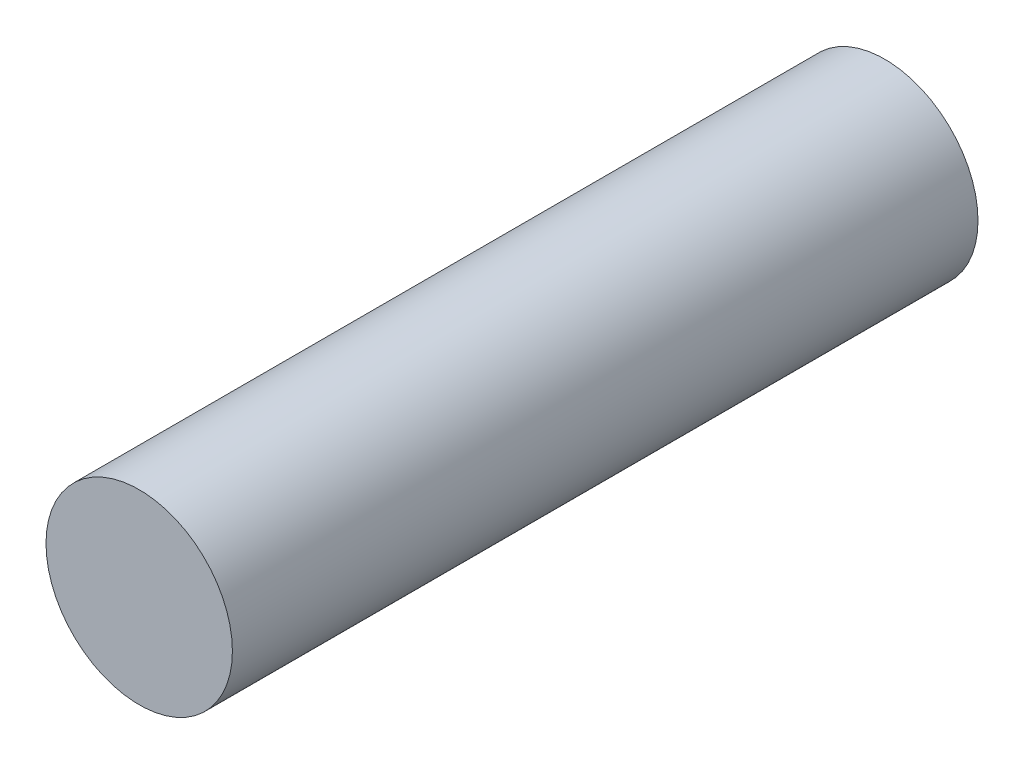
ISO-10303-21;
HEADER;
FILE_DESCRIPTION(('STEP AP214'),'2;1');
FILE_NAME('part.step','',(''),(''),'','','');
FILE_SCHEMA(('AUTOMOTIVE_DESIGN { 1 0 10303 214 1 1 1 1 }'));
ENDSEC;
DATA;
#1=APPLICATION_CONTEXT('core data for automotive mechanical design processes');
#2=APPLICATION_PROTOCOL_DEFINITION('international standard','automotive_design',2000,#1);
#3=PRODUCT_CONTEXT('',#1,'mechanical');
#4=PRODUCT('Part','Part','',(#3));
#5=PRODUCT_RELATED_PRODUCT_CATEGORY('part','',(#4));
#6=PRODUCT_DEFINITION_FORMATION('','',#4);
#7=PRODUCT_DEFINITION_CONTEXT('part definition',#1,'design');
#8=PRODUCT_DEFINITION('design','',#6,#7);
#9=PRODUCT_DEFINITION_SHAPE('','',#8);
#10=(LENGTH_UNIT() NAMED_UNIT(*) SI_UNIT(.MILLI.,.METRE.));
#11=(NAMED_UNIT(*) PLANE_ANGLE_UNIT() SI_UNIT($,.RADIAN.));
#12=(NAMED_UNIT(*) SI_UNIT($,.STERADIAN.) SOLID_ANGLE_UNIT());
#13=UNCERTAINTY_MEASURE_WITH_UNIT(LENGTH_MEASURE(1.E-05),#10,'distance_accuracy_value','');
#14=(GEOMETRIC_REPRESENTATION_CONTEXT(3) GLOBAL_UNCERTAINTY_ASSIGNED_CONTEXT((#13)) GLOBAL_UNIT_ASSIGNED_CONTEXT((#10,
#11,#12)) REPRESENTATION_CONTEXT('',''));
#15=CARTESIAN_POINT('',(0.,0.,0.));
#16=DIRECTION('',(0.,0.,1.));
#17=DIRECTION('',(1.,0.,0.));
#18=AXIS2_PLACEMENT_3D('',#15,#16,#17);
#19=CARTESIAN_POINT('',(0.,0.,38.));
#20=DIRECTION('',(0.,0.,-1.));
#21=DIRECTION('',(-1.,0.,0.));
#22=AXIS2_PLACEMENT_3D('',#19,#20,#21);
#23=CYLINDRICAL_SURFACE('',#22,4.75);
#24=CARTESIAN_POINT('',(0.,0.,38.));
#25=DIRECTION('',(0.,0.,1.));
#26=DIRECTION('',(1.,0.,0.));
#27=AXIS2_PLACEMENT_3D('',#24,#25,#26);
#28=CIRCLE('',#27,4.75);
#29=CARTESIAN_POINT('',(4.75,0.,38.));
#30=VERTEX_POINT('',#29);
#31=EDGE_CURVE('E10',#30,#30,#28,.T.);
#32=ORIENTED_EDGE('',*,*,#31,.F.);
#33=EDGE_LOOP('',(#32));
#34=FACE_BOUND('',#33,.T.);
#35=CARTESIAN_POINT('',(0.,0.,0.));
#36=DIRECTION('',(0.,0.,1.));
#37=DIRECTION('',(1.,0.,0.));
#38=AXIS2_PLACEMENT_3D('',#35,#36,#37);
#39=CIRCLE('',#38,4.75);
#40=CARTESIAN_POINT('',(4.75,0.,0.));
#41=VERTEX_POINT('',#40);
#42=EDGE_CURVE('E33',#41,#41,#39,.T.);
#43=ORIENTED_EDGE('',*,*,#42,.T.);
#44=EDGE_LOOP('',(#43));
#45=FACE_BOUND('',#44,.T.);
#46=ADVANCED_FACE('F30',(#34,#45),#23,.T.);
#47=CARTESIAN_POINT('',(0.,0.,38.));
#48=DIRECTION('',(0.,0.,1.));
#49=DIRECTION('',(1.,0.,0.));
#50=AXIS2_PLACEMENT_3D('',#47,#48,#49);
#51=PLANE('',#50);
#52=ORIENTED_EDGE('',*,*,#31,.T.);
#53=EDGE_LOOP('',(#52));
#54=FACE_BOUND('',#53,.T.);
#55=ADVANCED_FACE('F45',(#54),#51,.T.);
#56=CARTESIAN_POINT('',(0.,0.,0.));
#57=DIRECTION('',(0.,0.,1.));
#58=DIRECTION('',(1.,0.,0.));
#59=AXIS2_PLACEMENT_3D('',#56,#57,#58);
#60=PLANE('',#59);
#61=ORIENTED_EDGE('',*,*,#42,.F.);
#62=EDGE_LOOP('',(#61));
#63=FACE_BOUND('',#62,.T.);
#64=ADVANCED_FACE('F43',(#63),#60,.F.);
#65=CLOSED_SHELL('',(#46,#55,#64));
#66=MANIFOLD_SOLID_BREP('B2',#65);
#67=ADVANCED_BREP_SHAPE_REPRESENTATION('',(#18,#66),#14);
#68=SHAPE_DEFINITION_REPRESENTATION(#9,#67);
ENDSEC;
END-ISO-10303-21;
